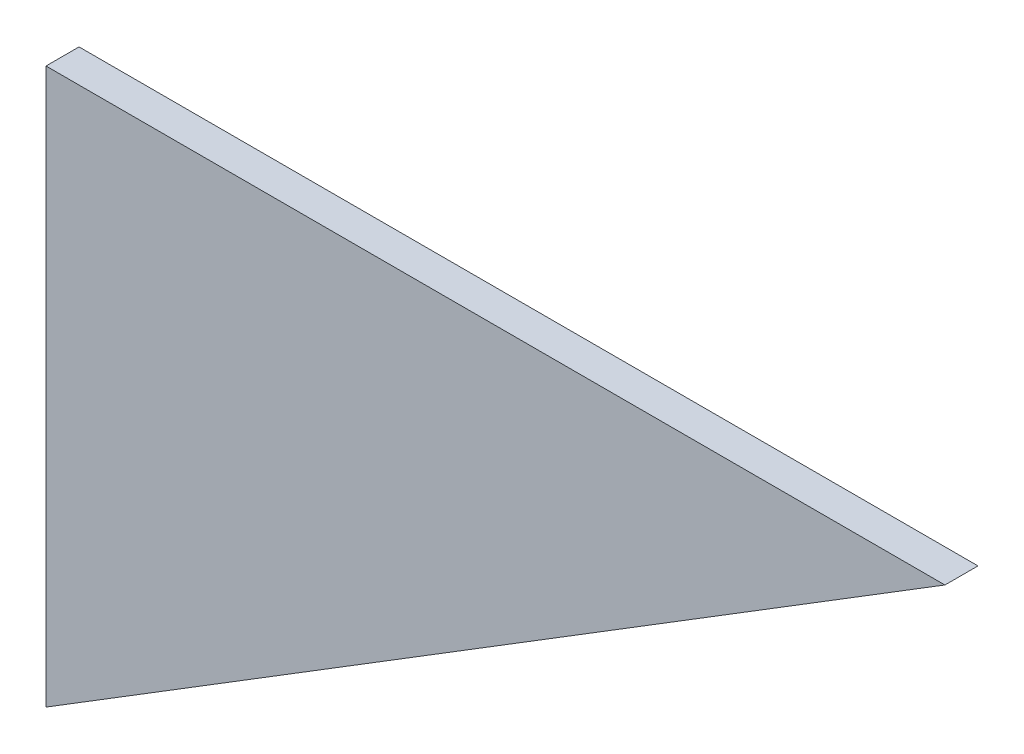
ISO-10303-21;
HEADER;
FILE_DESCRIPTION(('STEP AP214'),'2;1');
FILE_NAME('part.step','',(''),(''),'','','');
FILE_SCHEMA(('AUTOMOTIVE_DESIGN { 1 0 10303 214 1 1 1 1 }'));
ENDSEC;
DATA;
#1=APPLICATION_CONTEXT('core data for automotive mechanical design processes');
#2=APPLICATION_PROTOCOL_DEFINITION('international standard','automotive_design',2000,#1);
#3=PRODUCT_CONTEXT('',#1,'mechanical');
#4=PRODUCT('Part','Part','',(#3));
#5=PRODUCT_RELATED_PRODUCT_CATEGORY('part','',(#4));
#6=PRODUCT_DEFINITION_FORMATION('','',#4);
#7=PRODUCT_DEFINITION_CONTEXT('part definition',#1,'design');
#8=PRODUCT_DEFINITION('design','',#6,#7);
#9=PRODUCT_DEFINITION_SHAPE('','',#8);
#10=(LENGTH_UNIT() NAMED_UNIT(*) SI_UNIT(.MILLI.,.METRE.));
#11=(NAMED_UNIT(*) PLANE_ANGLE_UNIT() SI_UNIT($,.RADIAN.));
#12=(NAMED_UNIT(*) SI_UNIT($,.STERADIAN.) SOLID_ANGLE_UNIT());
#13=UNCERTAINTY_MEASURE_WITH_UNIT(LENGTH_MEASURE(1.E-05),#10,'distance_accuracy_value','');
#14=(GEOMETRIC_REPRESENTATION_CONTEXT(3) GLOBAL_UNCERTAINTY_ASSIGNED_CONTEXT((#13)) GLOBAL_UNIT_ASSIGNED_CONTEXT((#10,
#11,#12)) REPRESENTATION_CONTEXT('',''));
#15=CARTESIAN_POINT('',(0.,0.,0.));
#16=DIRECTION('',(0.,0.,1.));
#17=DIRECTION('',(1.,0.,0.));
#18=AXIS2_PLACEMENT_3D('',#15,#16,#17);
#19=CARTESIAN_POINT('',(93.4826086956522,28.3955434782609,5.));
#20=DIRECTION('',(0.,-1.,0.));
#21=DIRECTION('',(1.,0.,0.));
#22=AXIS2_PLACEMENT_3D('',#19,#20,#21);
#23=PLANE('',#22);
#24=DIRECTION('',(-1.,0.,0.));
#25=VECTOR('',#24,1.);
#26=CARTESIAN_POINT('',(93.4826086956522,28.3955434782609,0.));
#27=LINE('',#26,#25);
#28=CARTESIAN_POINT('',(93.4826086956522,28.3955434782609,0.));
#29=VERTEX_POINT('',#28);
#30=CARTESIAN_POINT('',(-42.5173913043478,28.3955434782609,0.));
#31=VERTEX_POINT('',#30);
#32=EDGE_CURVE('E62',#29,#31,#27,.T.);
#33=ORIENTED_EDGE('',*,*,#32,.T.);
#34=DIRECTION('',(0.,0.,-1.));
#35=VECTOR('',#34,1.);
#36=CARTESIAN_POINT('',(-42.5173913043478,28.3955434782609,5.));
#37=LINE('',#36,#35);
#38=CARTESIAN_POINT('',(-42.5173913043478,28.3955434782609,5.));
#39=VERTEX_POINT('',#38);
#40=EDGE_CURVE('E11',#39,#31,#37,.T.);
#41=ORIENTED_EDGE('',*,*,#40,.F.);
#42=DIRECTION('',(-1.,0.,0.));
#43=VECTOR('',#42,1.);
#44=CARTESIAN_POINT('',(93.4826086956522,28.3955434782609,5.));
#45=LINE('',#44,#43);
#46=CARTESIAN_POINT('',(93.4826086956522,28.3955434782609,5.));
#47=VERTEX_POINT('',#46);
#48=EDGE_CURVE('E76',#47,#39,#45,.T.);
#49=ORIENTED_EDGE('',*,*,#48,.F.);
#50=DIRECTION('',(0.,0.,-1.));
#51=VECTOR('',#50,1.);
#52=CARTESIAN_POINT('',(93.4826086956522,28.3955434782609,5.));
#53=LINE('',#52,#51);
#54=EDGE_CURVE('E72',#47,#29,#53,.T.);
#55=ORIENTED_EDGE('',*,*,#54,.T.);
#56=EDGE_LOOP('',(#33,#41,#49,#55));
#57=FACE_BOUND('',#56,.T.);
#58=ADVANCED_FACE('F26',(#57),#23,.F.);
#59=CARTESIAN_POINT('',(-42.5173913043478,28.3955434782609,5.));
#60=DIRECTION('',(1.,0.,0.));
#61=DIRECTION('',(0.,1.,0.));
#62=AXIS2_PLACEMENT_3D('',#59,#60,#61);
#63=PLANE('',#62);
#64=DIRECTION('',(0.,-1.,0.));
#65=VECTOR('',#64,1.);
#66=CARTESIAN_POINT('',(-42.5173913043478,28.3955434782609,0.));
#67=LINE('',#66,#65);
#68=CARTESIAN_POINT('',(-42.5173913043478,-55.6044565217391,0.));
#69=VERTEX_POINT('',#68);
#70=EDGE_CURVE('E59',#31,#69,#67,.T.);
#71=ORIENTED_EDGE('',*,*,#70,.T.);
#72=DIRECTION('',(0.,0.,-1.));
#73=VECTOR('',#72,1.);
#74=CARTESIAN_POINT('',(-42.5173913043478,-55.6044565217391,5.));
#75=LINE('',#74,#73);
#76=CARTESIAN_POINT('',(-42.5173913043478,-55.6044565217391,5.));
#77=VERTEX_POINT('',#76);
#78=EDGE_CURVE('E33',#77,#69,#75,.T.);
#79=ORIENTED_EDGE('',*,*,#78,.F.);
#80=DIRECTION('',(0.,-1.,0.));
#81=VECTOR('',#80,1.);
#82=CARTESIAN_POINT('',(-42.5173913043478,28.3955434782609,5.));
#83=LINE('',#82,#81);
#84=EDGE_CURVE('E44',#39,#77,#83,.T.);
#85=ORIENTED_EDGE('',*,*,#84,.F.);
#86=ORIENTED_EDGE('',*,*,#40,.T.);
#87=EDGE_LOOP('',(#71,#79,#85,#86));
#88=FACE_BOUND('',#87,.T.);
#89=ADVANCED_FACE('F68',(#88),#63,.F.);
#90=CARTESIAN_POINT('',(-42.5173913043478,-55.6044565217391,5.));
#91=DIRECTION('',(-0.525492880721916,0.850797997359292,0.));
#92=DIRECTION('',(-0.850797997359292,-0.525492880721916,0.));
#93=AXIS2_PLACEMENT_3D('',#90,#91,#92);
#94=PLANE('',#93);
#95=DIRECTION('',(0.850797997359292,0.525492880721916,0.));
#96=VECTOR('',#95,1.);
#97=CARTESIAN_POINT('',(-42.5173913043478,-55.6044565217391,0.));
#98=LINE('',#97,#96);
#99=EDGE_CURVE('E63',#69,#29,#98,.T.);
#100=ORIENTED_EDGE('',*,*,#99,.T.);
#101=ORIENTED_EDGE('',*,*,#54,.F.);
#102=DIRECTION('',(0.850797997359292,0.525492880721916,0.));
#103=VECTOR('',#102,1.);
#104=CARTESIAN_POINT('',(-42.5173913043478,-55.6044565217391,5.));
#105=LINE('',#104,#103);
#106=EDGE_CURVE('E40',#77,#47,#105,.T.);
#107=ORIENTED_EDGE('',*,*,#106,.F.);
#108=ORIENTED_EDGE('',*,*,#78,.T.);
#109=EDGE_LOOP('',(#100,#101,#107,#108));
#110=FACE_BOUND('',#109,.T.);
#111=ADVANCED_FACE('F81',(#110),#94,.F.);
#112=CARTESIAN_POINT('',(-42.5173913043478,28.3955434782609,5.));
#113=DIRECTION('',(0.,0.,1.));
#114=DIRECTION('',(1.,0.,0.));
#115=AXIS2_PLACEMENT_3D('',#112,#113,#114);
#116=PLANE('',#115);
#117=ORIENTED_EDGE('',*,*,#48,.T.);
#118=ORIENTED_EDGE('',*,*,#84,.T.);
#119=ORIENTED_EDGE('',*,*,#106,.T.);
#120=EDGE_LOOP('',(#117,#118,#119));
#121=FACE_BOUND('',#120,.T.);
#122=ADVANCED_FACE('F82',(#121),#116,.T.);
#123=CARTESIAN_POINT('',(-42.5173913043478,28.3955434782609,0.));
#124=DIRECTION('',(0.,0.,1.));
#125=DIRECTION('',(1.,0.,0.));
#126=AXIS2_PLACEMENT_3D('',#123,#124,#125);
#127=PLANE('',#126);
#128=ORIENTED_EDGE('',*,*,#32,.F.);
#129=ORIENTED_EDGE('',*,*,#99,.F.);
#130=ORIENTED_EDGE('',*,*,#70,.F.);
#131=EDGE_LOOP('',(#128,#129,#130));
#132=FACE_BOUND('',#131,.T.);
#133=ADVANCED_FACE('F60',(#132),#127,.F.);
#134=CLOSED_SHELL('',(#58,#89,#111,#122,#133));
#135=MANIFOLD_SOLID_BREP('B2',#134);
#136=ADVANCED_BREP_SHAPE_REPRESENTATION('',(#18,#135),#14);
#137=SHAPE_DEFINITION_REPRESENTATION(#9,#136);
ENDSEC;
END-ISO-10303-21;
